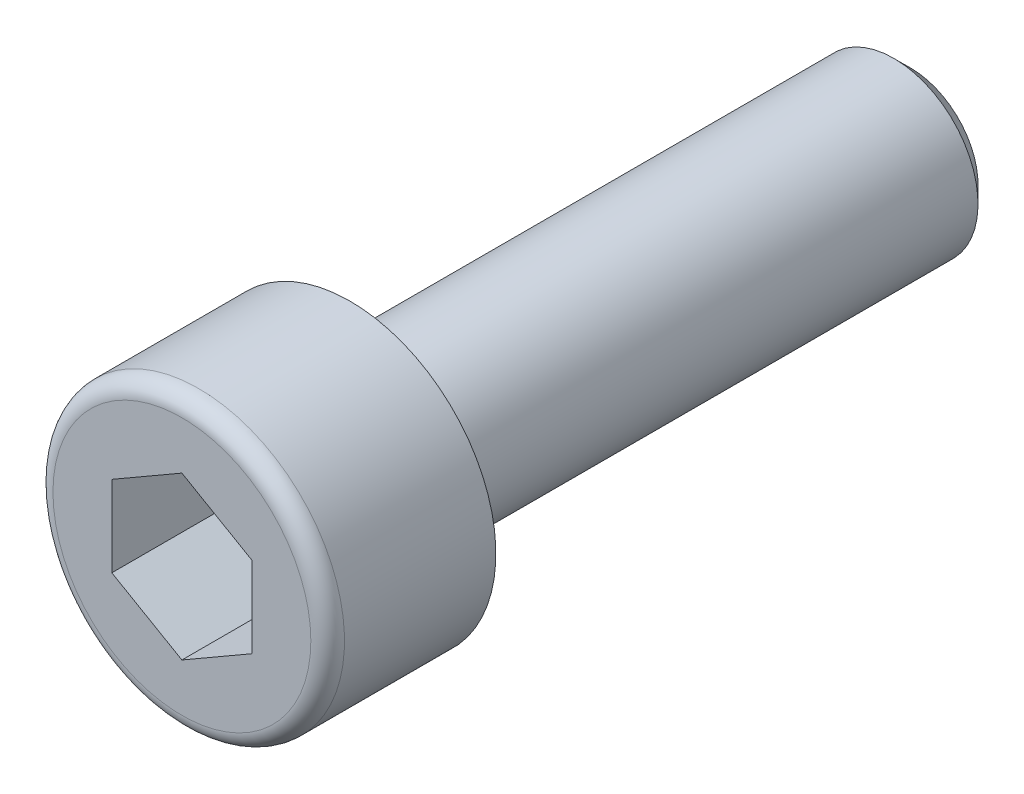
ISO-10303-21;
HEADER;
FILE_DESCRIPTION(('STEP AP214'),'2;1');
FILE_NAME('part.step','',(''),(''),'','','');
FILE_SCHEMA(('AUTOMOTIVE_DESIGN { 1 0 10303 214 1 1 1 1 }'));
ENDSEC;
DATA;
#1=APPLICATION_CONTEXT('core data for automotive mechanical design processes');
#2=APPLICATION_PROTOCOL_DEFINITION('international standard','automotive_design',2000,#1);
#3=PRODUCT_CONTEXT('',#1,'mechanical');
#4=PRODUCT('Part','Part','',(#3));
#5=PRODUCT_RELATED_PRODUCT_CATEGORY('part','',(#4));
#6=PRODUCT_DEFINITION_FORMATION('','',#4);
#7=PRODUCT_DEFINITION_CONTEXT('part definition',#1,'design');
#8=PRODUCT_DEFINITION('design','',#6,#7);
#9=PRODUCT_DEFINITION_SHAPE('','',#8);
#10=(LENGTH_UNIT() NAMED_UNIT(*) SI_UNIT(.MILLI.,.METRE.));
#11=(NAMED_UNIT(*) PLANE_ANGLE_UNIT() SI_UNIT($,.RADIAN.));
#12=(NAMED_UNIT(*) SI_UNIT($,.STERADIAN.) SOLID_ANGLE_UNIT());
#13=UNCERTAINTY_MEASURE_WITH_UNIT(LENGTH_MEASURE(1.E-05),#10,'distance_accuracy_value','');
#14=(GEOMETRIC_REPRESENTATION_CONTEXT(3) GLOBAL_UNCERTAINTY_ASSIGNED_CONTEXT((#13)) GLOBAL_UNIT_ASSIGNED_CONTEXT((#10,
#11,#12)) REPRESENTATION_CONTEXT('',''));
#15=CARTESIAN_POINT('',(0.,0.,0.));
#16=DIRECTION('',(0.,0.,1.));
#17=DIRECTION('',(1.,0.,0.));
#18=AXIS2_PLACEMENT_3D('',#15,#16,#17);
#19=CARTESIAN_POINT('',(0.,0.,0.));
#20=DIRECTION('',(0.,0.,1.));
#21=DIRECTION('',(-0.127409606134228,-0.991850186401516,0.));
#22=AXIS2_PLACEMENT_3D('',#19,#20,#21);
#23=CYLINDRICAL_SURFACE('',#22,5.2);
#24=CARTESIAN_POINT('',(0.,0.,5.4));
#25=DIRECTION('',(0.,0.,-1.));
#26=DIRECTION('',(-1.,0.,0.));
#27=AXIS2_PLACEMENT_3D('',#24,#25,#26);
#28=CIRCLE('',#27,5.2);
#29=CARTESIAN_POINT('',(-5.2,0.,5.4));
#30=VERTEX_POINT('',#29);
#31=EDGE_CURVE('E22',#30,#30,#28,.T.);
#32=ORIENTED_EDGE('',*,*,#31,.T.);
#33=EDGE_LOOP('',(#32));
#34=FACE_BOUND('',#33,.T.);
#35=CARTESIAN_POINT('',(0.,0.,0.));
#36=DIRECTION('',(0.,0.,1.));
#37=DIRECTION('',(-0.127409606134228,-0.991850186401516,0.));
#38=AXIS2_PLACEMENT_3D('',#35,#36,#37);
#39=CIRCLE('',#38,5.2);
#40=CARTESIAN_POINT('',(-0.662529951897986,-5.15762096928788,0.));
#41=VERTEX_POINT('',#40);
#42=EDGE_CURVE('E124',#41,#41,#39,.F.);
#43=ORIENTED_EDGE('',*,*,#42,.F.);
#44=EDGE_LOOP('',(#43));
#45=FACE_BOUND('',#44,.T.);
#46=ADVANCED_FACE('F14',(#34,#45),#23,.T.);
#47=CARTESIAN_POINT('',(0.,0.,0.));
#48=DIRECTION('',(0.,0.,-1.));
#49=DIRECTION('',(0.127409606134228,0.991850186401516,0.));
#50=AXIS2_PLACEMENT_3D('',#47,#48,#49);
#51=PLANE('',#50);
#52=ORIENTED_EDGE('',*,*,#42,.T.);
#53=EDGE_LOOP('',(#52));
#54=FACE_BOUND('',#53,.T.);
#55=CARTESIAN_POINT('',(0.,0.,0.));
#56=DIRECTION('',(0.,0.,-1.));
#57=DIRECTION('',(0.127409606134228,0.991850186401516,0.));
#58=AXIS2_PLACEMENT_3D('',#55,#56,#57);
#59=CIRCLE('',#58,3.);
#60=CARTESIAN_POINT('',(0.382228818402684,2.97555055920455,0.));
#61=VERTEX_POINT('',#60);
#62=EDGE_CURVE('E116',#61,#61,#59,.T.);
#63=ORIENTED_EDGE('',*,*,#62,.F.);
#64=EDGE_LOOP('',(#63));
#65=FACE_BOUND('',#64,.T.);
#66=ADVANCED_FACE('F152',(#54,#65),#51,.T.);
#67=CARTESIAN_POINT('',(0.,0.,-16.));
#68=DIRECTION('',(0.,0.,1.));
#69=DIRECTION('',(-0.127409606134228,-0.991850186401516,0.));
#70=AXIS2_PLACEMENT_3D('',#67,#68,#69);
#71=CYLINDRICAL_SURFACE('',#70,3.);
#72=CARTESIAN_POINT('',(0.,0.,-19.4));
#73=DIRECTION('',(0.,0.,-1.));
#74=DIRECTION('',(0.127409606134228,0.991850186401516,0.));
#75=AXIS2_PLACEMENT_3D('',#72,#73,#74);
#76=CIRCLE('',#75,3.);
#77=CARTESIAN_POINT('',(0.382228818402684,2.97555055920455,-19.4));
#78=VERTEX_POINT('',#77);
#79=EDGE_CURVE('E130',#78,#78,#76,.F.);
#80=ORIENTED_EDGE('',*,*,#79,.T.);
#81=EDGE_LOOP('',(#80));
#82=FACE_BOUND('',#81,.T.);
#83=ORIENTED_EDGE('',*,*,#62,.T.);
#84=EDGE_LOOP('',(#83));
#85=FACE_BOUND('',#84,.T.);
#86=ADVANCED_FACE('F154',(#82,#85),#71,.T.);
#87=CARTESIAN_POINT('',(0.,0.,-20.));
#88=DIRECTION('',(0.,0.,-1.));
#89=DIRECTION('',(0.127409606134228,0.991850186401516,0.));
#90=AXIS2_PLACEMENT_3D('',#87,#88,#89);
#91=PLANE('',#90);
#92=CARTESIAN_POINT('',(0.,0.,-20.));
#93=DIRECTION('',(0.,0.,-1.));
#94=DIRECTION('',(0.127409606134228,0.991850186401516,0.));
#95=AXIS2_PLACEMENT_3D('',#92,#93,#94);
#96=CIRCLE('',#95,2.4);
#97=CARTESIAN_POINT('',(0.305783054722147,2.38044044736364,-20.));
#98=VERTEX_POINT('',#97);
#99=EDGE_CURVE('E127',#98,#98,#96,.T.);
#100=ORIENTED_EDGE('',*,*,#99,.T.);
#101=EDGE_LOOP('',(#100));
#102=FACE_BOUND('',#101,.T.);
#103=ADVANCED_FACE('F161',(#102),#91,.T.);
#104=CARTESIAN_POINT('',(0.,0.,-20.));
#105=DIRECTION('',(0.,0.,1.));
#106=DIRECTION('',(-0.127409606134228,-0.991850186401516,0.));
#107=AXIS2_PLACEMENT_3D('',#104,#105,#106);
#108=CONICAL_SURFACE('',#107,2.4,0.785398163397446);
#109=ORIENTED_EDGE('',*,*,#79,.F.);
#110=EDGE_LOOP('',(#109));
#111=FACE_BOUND('',#110,.T.);
#112=ORIENTED_EDGE('',*,*,#99,.F.);
#113=EDGE_LOOP('',(#112));
#114=FACE_BOUND('',#113,.T.);
#115=ADVANCED_FACE('F148',(#111,#114),#108,.T.);
#116=CARTESIAN_POINT('',(0.,0.,6.));
#117=DIRECTION('',(0.,0.,-1.));
#118=DIRECTION('',(-1.,0.,0.));
#119=AXIS2_PLACEMENT_3D('',#116,#117,#118);
#120=PLANE('',#119);
#121=DIRECTION('',(-0.866025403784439,-0.5,0.));
#122=VECTOR('',#121,1.);
#123=CARTESIAN_POINT('',(0.,2.88675134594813,6.));
#124=LINE('',#123,#122);
#125=CARTESIAN_POINT('',(0.,2.88675134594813,6.));
#126=VERTEX_POINT('',#125);
#127=CARTESIAN_POINT('',(-2.5,1.44337567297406,6.));
#128=VERTEX_POINT('',#127);
#129=EDGE_CURVE('E103',#126,#128,#124,.T.);
#130=ORIENTED_EDGE('',*,*,#129,.F.);
#131=DIRECTION('',(-0.866025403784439,0.5,0.));
#132=VECTOR('',#131,1.);
#133=CARTESIAN_POINT('',(2.5,1.44337567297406,6.));
#134=LINE('',#133,#132);
#135=CARTESIAN_POINT('',(2.5,1.44337567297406,6.));
#136=VERTEX_POINT('',#135);
#137=EDGE_CURVE('E29',#136,#126,#134,.T.);
#138=ORIENTED_EDGE('',*,*,#137,.F.);
#139=DIRECTION('',(0.,1.,0.));
#140=VECTOR('',#139,1.);
#141=CARTESIAN_POINT('',(2.5,-1.44337567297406,6.));
#142=LINE('',#141,#140);
#143=CARTESIAN_POINT('',(2.5,-1.44337567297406,6.));
#144=VERTEX_POINT('',#143);
#145=EDGE_CURVE('E112',#144,#136,#142,.T.);
#146=ORIENTED_EDGE('',*,*,#145,.F.);
#147=DIRECTION('',(0.866025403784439,0.5,0.));
#148=VECTOR('',#147,1.);
#149=CARTESIAN_POINT('',(0.,-2.88675134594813,6.));
#150=LINE('',#149,#148);
#151=CARTESIAN_POINT('',(0.,-2.88675134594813,6.));
#152=VERTEX_POINT('',#151);
#153=EDGE_CURVE('E110',#152,#144,#150,.T.);
#154=ORIENTED_EDGE('',*,*,#153,.F.);
#155=DIRECTION('',(0.866025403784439,-0.5,0.));
#156=VECTOR('',#155,1.);
#157=CARTESIAN_POINT('',(-2.5,-1.44337567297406,6.));
#158=LINE('',#157,#156);
#159=CARTESIAN_POINT('',(-2.5,-1.44337567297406,6.));
#160=VERTEX_POINT('',#159);
#161=EDGE_CURVE('E77',#160,#152,#158,.T.);
#162=ORIENTED_EDGE('',*,*,#161,.F.);
#163=DIRECTION('',(0.,-1.,0.));
#164=VECTOR('',#163,1.);
#165=CARTESIAN_POINT('',(-2.5,1.44337567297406,6.));
#166=LINE('',#165,#164);
#167=EDGE_CURVE('E106',#128,#160,#166,.T.);
#168=ORIENTED_EDGE('',*,*,#167,.F.);
#169=EDGE_LOOP('',(#130,#138,#146,#154,#162,#168));
#170=FACE_BOUND('',#169,.T.);
#171=CARTESIAN_POINT('',(0.,0.,6.));
#172=DIRECTION('',(0.,0.,-1.));
#173=DIRECTION('',(-1.,0.,0.));
#174=AXIS2_PLACEMENT_3D('',#171,#172,#173);
#175=CIRCLE('',#174,4.6);
#176=CARTESIAN_POINT('',(-4.6,0.,6.));
#177=VERTEX_POINT('',#176);
#178=EDGE_CURVE('E9',#177,#177,#175,.F.);
#179=ORIENTED_EDGE('',*,*,#178,.T.);
#180=EDGE_LOOP('',(#179));
#181=FACE_BOUND('',#180,.T.);
#182=ADVANCED_FACE('F139',(#170,#181),#120,.F.);
#183=CARTESIAN_POINT('',(0.,0.,5.4));
#184=DIRECTION('',(0.,0.,-1.));
#185=DIRECTION('',(-1.,0.,0.));
#186=AXIS2_PLACEMENT_3D('',#183,#184,#185);
#187=TOROIDAL_SURFACE('',#186,4.6,0.6);
#188=ORIENTED_EDGE('',*,*,#178,.F.);
#189=EDGE_LOOP('',(#188));
#190=FACE_BOUND('',#189,.T.);
#191=ORIENTED_EDGE('',*,*,#31,.F.);
#192=EDGE_LOOP('',(#191));
#193=FACE_BOUND('',#192,.T.);
#194=ADVANCED_FACE('F16',(#190,#193),#187,.T.);
#195=CARTESIAN_POINT('',(2.5,1.44337567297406,2.));
#196=DIRECTION('',(0.5,0.866025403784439,0.));
#197=DIRECTION('',(-0.866025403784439,0.5,0.));
#198=AXIS2_PLACEMENT_3D('',#195,#196,#197);
#199=PLANE('',#198);
#200=ORIENTED_EDGE('',*,*,#137,.T.);
#201=DIRECTION('',(0.,0.,1.));
#202=VECTOR('',#201,1.);
#203=CARTESIAN_POINT('',(0.,2.88675134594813,2.));
#204=LINE('',#203,#202);
#205=CARTESIAN_POINT('',(0.,2.88675134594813,2.));
#206=VERTEX_POINT('',#205);
#207=EDGE_CURVE('E59',#206,#126,#204,.T.);
#208=ORIENTED_EDGE('',*,*,#207,.F.);
#209=DIRECTION('',(-0.866025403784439,0.5,0.));
#210=VECTOR('',#209,1.);
#211=CARTESIAN_POINT('',(2.5,1.44337567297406,2.));
#212=LINE('',#211,#210);
#213=CARTESIAN_POINT('',(2.5,1.44337567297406,2.));
#214=VERTEX_POINT('',#213);
#215=EDGE_CURVE('E114',#214,#206,#212,.T.);
#216=ORIENTED_EDGE('',*,*,#215,.F.);
#217=DIRECTION('',(0.,0.,1.));
#218=VECTOR('',#217,1.);
#219=CARTESIAN_POINT('',(2.5,1.44337567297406,2.));
#220=LINE('',#219,#218);
#221=EDGE_CURVE('E37',#214,#136,#220,.T.);
#222=ORIENTED_EDGE('',*,*,#221,.T.);
#223=EDGE_LOOP('',(#200,#208,#216,#222));
#224=FACE_BOUND('',#223,.T.);
#225=ADVANCED_FACE('F138',(#224),#199,.F.);
#226=CARTESIAN_POINT('',(2.5,-1.44337567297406,2.));
#227=DIRECTION('',(1.,0.,0.));
#228=DIRECTION('',(0.,0.,-1.));
#229=AXIS2_PLACEMENT_3D('',#226,#227,#228);
#230=PLANE('',#229);
#231=ORIENTED_EDGE('',*,*,#145,.T.);
#232=ORIENTED_EDGE('',*,*,#221,.F.);
#233=DIRECTION('',(0.,1.,0.));
#234=VECTOR('',#233,1.);
#235=CARTESIAN_POINT('',(2.5,-1.44337567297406,2.));
#236=LINE('',#235,#234);
#237=CARTESIAN_POINT('',(2.5,-1.44337567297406,2.));
#238=VERTEX_POINT('',#237);
#239=EDGE_CURVE('E89',#238,#214,#236,.T.);
#240=ORIENTED_EDGE('',*,*,#239,.F.);
#241=DIRECTION('',(0.,0.,1.));
#242=VECTOR('',#241,1.);
#243=CARTESIAN_POINT('',(2.5,-1.44337567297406,2.));
#244=LINE('',#243,#242);
#245=EDGE_CURVE('E81',#238,#144,#244,.T.);
#246=ORIENTED_EDGE('',*,*,#245,.T.);
#247=EDGE_LOOP('',(#231,#232,#240,#246));
#248=FACE_BOUND('',#247,.T.);
#249=ADVANCED_FACE('F146',(#248),#230,.F.);
#250=CARTESIAN_POINT('',(0.,-2.88675134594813,2.));
#251=DIRECTION('',(0.5,-0.866025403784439,0.));
#252=DIRECTION('',(0.866025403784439,0.5,0.));
#253=AXIS2_PLACEMENT_3D('',#250,#251,#252);
#254=PLANE('',#253);
#255=ORIENTED_EDGE('',*,*,#153,.T.);
#256=ORIENTED_EDGE('',*,*,#245,.F.);
#257=DIRECTION('',(0.866025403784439,0.5,0.));
#258=VECTOR('',#257,1.);
#259=CARTESIAN_POINT('',(0.,-2.88675134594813,2.));
#260=LINE('',#259,#258);
#261=CARTESIAN_POINT('',(0.,-2.88675134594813,2.));
#262=VERTEX_POINT('',#261);
#263=EDGE_CURVE('E85',#262,#238,#260,.T.);
#264=ORIENTED_EDGE('',*,*,#263,.F.);
#265=DIRECTION('',(0.,0.,1.));
#266=VECTOR('',#265,1.);
#267=CARTESIAN_POINT('',(0.,-2.88675134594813,2.));
#268=LINE('',#267,#266);
#269=EDGE_CURVE('E70',#262,#152,#268,.T.);
#270=ORIENTED_EDGE('',*,*,#269,.T.);
#271=EDGE_LOOP('',(#255,#256,#264,#270));
#272=FACE_BOUND('',#271,.T.);
#273=ADVANCED_FACE('F86',(#272),#254,.F.);
#274=CARTESIAN_POINT('',(-2.5,-1.44337567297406,2.));
#275=DIRECTION('',(-0.5,-0.866025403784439,0.));
#276=DIRECTION('',(0.866025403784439,-0.5,0.));
#277=AXIS2_PLACEMENT_3D('',#274,#275,#276);
#278=PLANE('',#277);
#279=ORIENTED_EDGE('',*,*,#161,.T.);
#280=ORIENTED_EDGE('',*,*,#269,.F.);
#281=DIRECTION('',(0.866025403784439,-0.5,0.));
#282=VECTOR('',#281,1.);
#283=CARTESIAN_POINT('',(-2.5,-1.44337567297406,2.));
#284=LINE('',#283,#282);
#285=CARTESIAN_POINT('',(-2.5,-1.44337567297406,2.));
#286=VERTEX_POINT('',#285);
#287=EDGE_CURVE('E74',#286,#262,#284,.T.);
#288=ORIENTED_EDGE('',*,*,#287,.F.);
#289=DIRECTION('',(0.,0.,1.));
#290=VECTOR('',#289,1.);
#291=CARTESIAN_POINT('',(-2.5,-1.44337567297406,2.));
#292=LINE('',#291,#290);
#293=EDGE_CURVE('E82',#286,#160,#292,.T.);
#294=ORIENTED_EDGE('',*,*,#293,.T.);
#295=EDGE_LOOP('',(#279,#280,#288,#294));
#296=FACE_BOUND('',#295,.T.);
#297=ADVANCED_FACE('F72',(#296),#278,.F.);
#298=CARTESIAN_POINT('',(-2.5,1.44337567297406,2.));
#299=DIRECTION('',(-1.,0.,0.));
#300=DIRECTION('',(0.,0.,1.));
#301=AXIS2_PLACEMENT_3D('',#298,#299,#300);
#302=PLANE('',#301);
#303=ORIENTED_EDGE('',*,*,#167,.T.);
#304=ORIENTED_EDGE('',*,*,#293,.F.);
#305=DIRECTION('',(0.,-1.,0.));
#306=VECTOR('',#305,1.);
#307=CARTESIAN_POINT('',(-2.5,1.44337567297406,2.));
#308=LINE('',#307,#306);
#309=CARTESIAN_POINT('',(-2.5,1.44337567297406,2.));
#310=VERTEX_POINT('',#309);
#311=EDGE_CURVE('E95',#310,#286,#308,.T.);
#312=ORIENTED_EDGE('',*,*,#311,.F.);
#313=DIRECTION('',(0.,0.,1.));
#314=VECTOR('',#313,1.);
#315=CARTESIAN_POINT('',(-2.5,1.44337567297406,2.));
#316=LINE('',#315,#314);
#317=EDGE_CURVE('E119',#310,#128,#316,.T.);
#318=ORIENTED_EDGE('',*,*,#317,.T.);
#319=EDGE_LOOP('',(#303,#304,#312,#318));
#320=FACE_BOUND('',#319,.T.);
#321=ADVANCED_FACE('F184',(#320),#302,.F.);
#322=CARTESIAN_POINT('',(0.,2.88675134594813,2.));
#323=DIRECTION('',(-0.5,0.866025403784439,0.));
#324=DIRECTION('',(-0.866025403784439,-0.5,0.));
#325=AXIS2_PLACEMENT_3D('',#322,#323,#324);
#326=PLANE('',#325);
#327=ORIENTED_EDGE('',*,*,#129,.T.);
#328=ORIENTED_EDGE('',*,*,#317,.F.);
#329=DIRECTION('',(-0.866025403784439,-0.5,0.));
#330=VECTOR('',#329,1.);
#331=CARTESIAN_POINT('',(0.,2.88675134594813,2.));
#332=LINE('',#331,#330);
#333=EDGE_CURVE('E97',#206,#310,#332,.T.);
#334=ORIENTED_EDGE('',*,*,#333,.F.);
#335=ORIENTED_EDGE('',*,*,#207,.T.);
#336=EDGE_LOOP('',(#327,#328,#334,#335));
#337=FACE_BOUND('',#336,.T.);
#338=ADVANCED_FACE('F181',(#337),#326,.F.);
#339=CARTESIAN_POINT('',(0.,0.,2.));
#340=DIRECTION('',(0.,0.,1.));
#341=DIRECTION('',(1.,0.,0.));
#342=AXIS2_PLACEMENT_3D('',#339,#340,#341);
#343=PLANE('',#342);
#344=ORIENTED_EDGE('',*,*,#215,.T.);
#345=ORIENTED_EDGE('',*,*,#333,.T.);
#346=ORIENTED_EDGE('',*,*,#311,.T.);
#347=ORIENTED_EDGE('',*,*,#287,.T.);
#348=ORIENTED_EDGE('',*,*,#263,.T.);
#349=ORIENTED_EDGE('',*,*,#239,.T.);
#350=EDGE_LOOP('',(#344,#345,#346,#347,#348,#349));
#351=FACE_BOUND('',#350,.T.);
#352=ADVANCED_FACE('F92',(#351),#343,.T.);
#353=CLOSED_SHELL('',(#46,#66,#86,#103,#115,#182,#194,#225,#249,#273,#297,#321,#338,#352));
#354=MANIFOLD_SOLID_BREP('B1',#353);
#355=ADVANCED_BREP_SHAPE_REPRESENTATION('',(#18,#354),#14);
#356=SHAPE_DEFINITION_REPRESENTATION(#9,#355);
ENDSEC;
END-ISO-10303-21;
